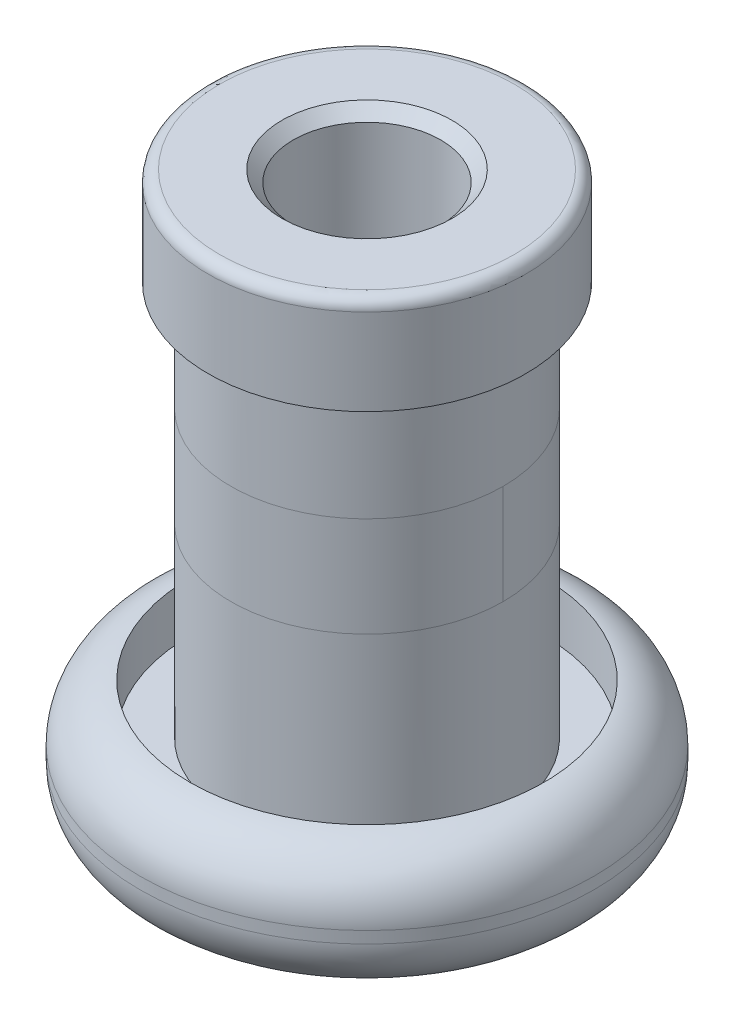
from build123d import *

# Parameters (mm, degrees)
CHAMFER1_SIZE = 0.635


with BuildPart() as part:
    # Sketch1 → Revolve1 (revolve)
    with BuildSketch(Plane.XY, mode=Mode.PRIVATE) as revolve1_sk:
        with BuildLine():
            Line((5.3975, 0), (9.525, 0))
            ThreePointArc((9.525, 0), (11.77006403, 0.92993597), (12.7, 3.175))
            Line((12.7, 3.175), (12.7, 3.832942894))
            ThreePointArc((12.7, 3.832942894), (11.900952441, 5.938999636), (9.906, 6.985))
            Line((9.906, 6.985), (9.906, 4.191))
            Line((9.906, 4.191), (7.62, 4.191))
            Line((7.62, 4.191), (7.62, 26.289))
            Line((7.62, 26.289), (8.89, 26.289))
            Line((8.89, 26.289), (8.89, 31.115))
            ThreePointArc((8.89, 31.115), (8.704012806, 31.564012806), (8.255, 31.75))
            Line((8.255, 31.75), (4.1275, 31.75))
            Line((4.1275, 31.75), (4.1275, 3.175))
            Line((4.1275, 3.175), (5.3975, 3.175))
            Line((5.3975, 3.175), (5.3975, 0))
        make_face()
    revolve(revolve1_sk.sketch.rotate(Axis((0, 0, 0), (0, 1, 0)), 90), axis=Axis((0, 0, 0), (0, 1, 0)))

    # Chamfer1
    chamfer1_edges = [part.edges().sort_by_distance(p)[0] for p in [
        (0, 31.75, 4.1275),
    ]]
    chamfer(chamfer1_edges, length=CHAMFER1_SIZE)


solid = part.part
